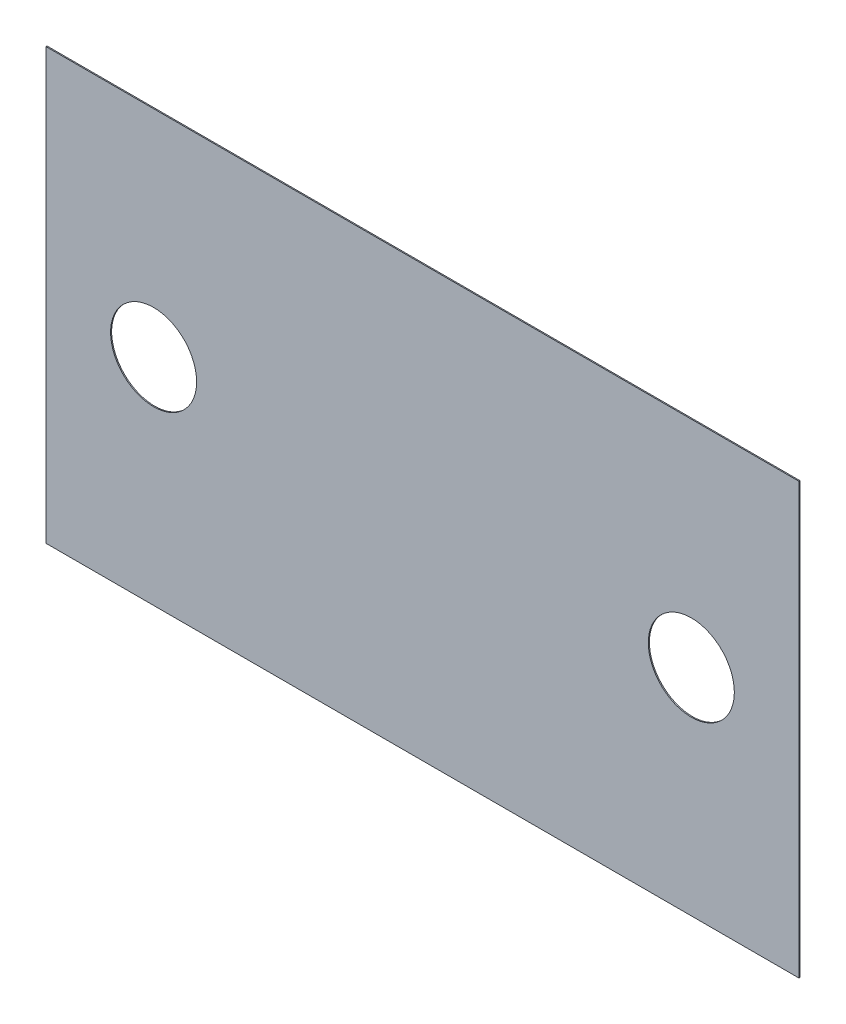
ISO-10303-21;
HEADER;
FILE_DESCRIPTION(('STEP AP214'),'2;1');
FILE_NAME('part.step','',(''),(''),'','','');
FILE_SCHEMA(('AUTOMOTIVE_DESIGN { 1 0 10303 214 1 1 1 1 }'));
ENDSEC;
DATA;
#1=APPLICATION_CONTEXT('core data for automotive mechanical design processes');
#2=APPLICATION_PROTOCOL_DEFINITION('international standard','automotive_design',2000,#1);
#3=PRODUCT_CONTEXT('',#1,'mechanical');
#4=PRODUCT('Part','Part','',(#3));
#5=PRODUCT_RELATED_PRODUCT_CATEGORY('part','',(#4));
#6=PRODUCT_DEFINITION_FORMATION('','',#4);
#7=PRODUCT_DEFINITION_CONTEXT('part definition',#1,'design');
#8=PRODUCT_DEFINITION('design','',#6,#7);
#9=PRODUCT_DEFINITION_SHAPE('','',#8);
#10=(LENGTH_UNIT() NAMED_UNIT(*) SI_UNIT(.MILLI.,.METRE.));
#11=(NAMED_UNIT(*) PLANE_ANGLE_UNIT() SI_UNIT($,.RADIAN.));
#12=(NAMED_UNIT(*) SI_UNIT($,.STERADIAN.) SOLID_ANGLE_UNIT());
#13=UNCERTAINTY_MEASURE_WITH_UNIT(LENGTH_MEASURE(1.E-05),#10,'distance_accuracy_value','');
#14=(GEOMETRIC_REPRESENTATION_CONTEXT(3) GLOBAL_UNCERTAINTY_ASSIGNED_CONTEXT((#13)) GLOBAL_UNIT_ASSIGNED_CONTEXT((#10,
#11,#12)) REPRESENTATION_CONTEXT('',''));
#15=CARTESIAN_POINT('',(0.,0.,0.));
#16=DIRECTION('',(0.,0.,1.));
#17=DIRECTION('',(1.,0.,0.));
#18=AXIS2_PLACEMENT_3D('',#15,#16,#17);
#19=CARTESIAN_POINT('',(-35.,-20.,0.1));
#20=DIRECTION('',(0.,0.,1.));
#21=DIRECTION('',(1.,0.,0.));
#22=AXIS2_PLACEMENT_3D('',#19,#20,#21);
#23=PLANE('',#22);
#24=CARTESIAN_POINT('',(-25.,0.,0.1));
#25=DIRECTION('',(0.,0.,1.));
#26=DIRECTION('',(1.,0.,0.));
#27=AXIS2_PLACEMENT_3D('',#24,#25,#26);
#28=CIRCLE('',#27,4.);
#29=CARTESIAN_POINT('',(-21.,0.,0.1));
#30=VERTEX_POINT('',#29);
#31=EDGE_CURVE('E97',#30,#30,#28,.T.);
#32=ORIENTED_EDGE('',*,*,#31,.F.);
#33=EDGE_LOOP('',(#32));
#34=FACE_BOUND('',#33,.T.);
#35=DIRECTION('',(0.,-1.,0.));
#36=VECTOR('',#35,1.);
#37=CARTESIAN_POINT('',(-35.,20.,0.1));
#38=LINE('',#37,#36);
#39=CARTESIAN_POINT('',(-35.,20.,0.1));
#40=VERTEX_POINT('',#39);
#41=CARTESIAN_POINT('',(-35.,-20.,0.1));
#42=VERTEX_POINT('',#41);
#43=EDGE_CURVE('E82',#40,#42,#38,.T.);
#44=ORIENTED_EDGE('',*,*,#43,.T.);
#45=DIRECTION('',(1.,0.,0.));
#46=VECTOR('',#45,1.);
#47=CARTESIAN_POINT('',(-35.,-20.,0.1));
#48=LINE('',#47,#46);
#49=CARTESIAN_POINT('',(35.,-20.,0.1));
#50=VERTEX_POINT('',#49);
#51=EDGE_CURVE('E77',#42,#50,#48,.T.);
#52=ORIENTED_EDGE('',*,*,#51,.T.);
#53=DIRECTION('',(0.,1.,0.));
#54=VECTOR('',#53,1.);
#55=CARTESIAN_POINT('',(35.,20.,0.1));
#56=LINE('',#55,#54);
#57=CARTESIAN_POINT('',(35.,20.,0.1));
#58=VERTEX_POINT('',#57);
#59=EDGE_CURVE('E80',#50,#58,#56,.T.);
#60=ORIENTED_EDGE('',*,*,#59,.T.);
#61=DIRECTION('',(-1.,0.,0.));
#62=VECTOR('',#61,1.);
#63=CARTESIAN_POINT('',(-35.,20.,0.1));
#64=LINE('',#63,#62);
#65=EDGE_CURVE('E47',#58,#40,#64,.T.);
#66=ORIENTED_EDGE('',*,*,#65,.T.);
#67=EDGE_LOOP('',(#44,#52,#60,#66));
#68=FACE_BOUND('',#67,.T.);
#69=CARTESIAN_POINT('',(25.,0.,0.1));
#70=DIRECTION('',(0.,0.,1.));
#71=DIRECTION('',(1.,0.,0.));
#72=AXIS2_PLACEMENT_3D('',#69,#70,#71);
#73=CIRCLE('',#72,4.);
#74=CARTESIAN_POINT('',(29.,0.,0.1));
#75=VERTEX_POINT('',#74);
#76=EDGE_CURVE('E112',#75,#75,#73,.T.);
#77=ORIENTED_EDGE('',*,*,#76,.F.);
#78=EDGE_LOOP('',(#77));
#79=FACE_BOUND('',#78,.T.);
#80=ADVANCED_FACE('F30',(#34,#68,#79),#23,.T.);
#81=CARTESIAN_POINT('',(-35.,-20.,0.));
#82=DIRECTION('',(0.,0.,1.));
#83=DIRECTION('',(1.,0.,0.));
#84=AXIS2_PLACEMENT_3D('',#81,#82,#83);
#85=PLANE('',#84);
#86=CARTESIAN_POINT('',(-25.,0.,0.));
#87=DIRECTION('',(0.,0.,1.));
#88=DIRECTION('',(1.,0.,0.));
#89=AXIS2_PLACEMENT_3D('',#86,#87,#88);
#90=CIRCLE('',#89,4.);
#91=CARTESIAN_POINT('',(-21.,0.,0.));
#92=VERTEX_POINT('',#91);
#93=EDGE_CURVE('E109',#92,#92,#90,.T.);
#94=ORIENTED_EDGE('',*,*,#93,.T.);
#95=EDGE_LOOP('',(#94));
#96=FACE_BOUND('',#95,.T.);
#97=DIRECTION('',(0.,-1.,0.));
#98=VECTOR('',#97,1.);
#99=CARTESIAN_POINT('',(-35.,20.,0.));
#100=LINE('',#99,#98);
#101=CARTESIAN_POINT('',(-35.,20.,0.));
#102=VERTEX_POINT('',#101);
#103=CARTESIAN_POINT('',(-35.,-20.,0.));
#104=VERTEX_POINT('',#103);
#105=EDGE_CURVE('E94',#102,#104,#100,.T.);
#106=ORIENTED_EDGE('',*,*,#105,.F.);
#107=DIRECTION('',(-1.,0.,0.));
#108=VECTOR('',#107,1.);
#109=CARTESIAN_POINT('',(-35.,20.,0.));
#110=LINE('',#109,#108);
#111=CARTESIAN_POINT('',(35.,20.,0.));
#112=VERTEX_POINT('',#111);
#113=EDGE_CURVE('E70',#112,#102,#110,.T.);
#114=ORIENTED_EDGE('',*,*,#113,.F.);
#115=DIRECTION('',(0.,1.,0.));
#116=VECTOR('',#115,1.);
#117=CARTESIAN_POINT('',(35.,20.,0.));
#118=LINE('',#117,#116);
#119=CARTESIAN_POINT('',(35.,-20.,0.));
#120=VERTEX_POINT('',#119);
#121=EDGE_CURVE('E64',#120,#112,#118,.T.);
#122=ORIENTED_EDGE('',*,*,#121,.F.);
#123=DIRECTION('',(1.,0.,0.));
#124=VECTOR('',#123,1.);
#125=CARTESIAN_POINT('',(-35.,-20.,0.));
#126=LINE('',#125,#124);
#127=EDGE_CURVE('E86',#104,#120,#126,.T.);
#128=ORIENTED_EDGE('',*,*,#127,.F.);
#129=EDGE_LOOP('',(#106,#114,#122,#128));
#130=FACE_BOUND('',#129,.T.);
#131=CARTESIAN_POINT('',(25.,0.,0.));
#132=DIRECTION('',(0.,0.,1.));
#133=DIRECTION('',(1.,0.,0.));
#134=AXIS2_PLACEMENT_3D('',#131,#132,#133);
#135=CIRCLE('',#134,4.);
#136=CARTESIAN_POINT('',(29.,0.,0.));
#137=VERTEX_POINT('',#136);
#138=EDGE_CURVE('E115',#137,#137,#135,.T.);
#139=ORIENTED_EDGE('',*,*,#138,.T.);
#140=EDGE_LOOP('',(#139));
#141=FACE_BOUND('',#140,.T.);
#142=ADVANCED_FACE('F105',(#96,#130,#141),#85,.F.);
#143=CARTESIAN_POINT('',(-35.,20.,0.1));
#144=DIRECTION('',(1.,0.,0.));
#145=DIRECTION('',(0.,1.,0.));
#146=AXIS2_PLACEMENT_3D('',#143,#144,#145);
#147=PLANE('',#146);
#148=ORIENTED_EDGE('',*,*,#105,.T.);
#149=DIRECTION('',(0.,0.,-1.));
#150=VECTOR('',#149,1.);
#151=CARTESIAN_POINT('',(-35.,-20.,0.1));
#152=LINE('',#151,#150);
#153=EDGE_CURVE('E11',#42,#104,#152,.T.);
#154=ORIENTED_EDGE('',*,*,#153,.F.);
#155=ORIENTED_EDGE('',*,*,#43,.F.);
#156=DIRECTION('',(0.,0.,-1.));
#157=VECTOR('',#156,1.);
#158=CARTESIAN_POINT('',(-35.,20.,0.1));
#159=LINE('',#158,#157);
#160=EDGE_CURVE('E90',#40,#102,#159,.T.);
#161=ORIENTED_EDGE('',*,*,#160,.T.);
#162=EDGE_LOOP('',(#148,#154,#155,#161));
#163=FACE_BOUND('',#162,.T.);
#164=ADVANCED_FACE('F32',(#163),#147,.F.);
#165=CARTESIAN_POINT('',(-35.,-20.,0.1));
#166=DIRECTION('',(0.,1.,0.));
#167=DIRECTION('',(0.,0.,1.));
#168=AXIS2_PLACEMENT_3D('',#165,#166,#167);
#169=PLANE('',#168);
#170=ORIENTED_EDGE('',*,*,#127,.T.);
#171=DIRECTION('',(0.,0.,-1.));
#172=VECTOR('',#171,1.);
#173=CARTESIAN_POINT('',(35.,-20.,0.1));
#174=LINE('',#173,#172);
#175=EDGE_CURVE('E39',#50,#120,#174,.T.);
#176=ORIENTED_EDGE('',*,*,#175,.F.);
#177=ORIENTED_EDGE('',*,*,#51,.F.);
#178=ORIENTED_EDGE('',*,*,#153,.T.);
#179=EDGE_LOOP('',(#170,#176,#177,#178));
#180=FACE_BOUND('',#179,.T.);
#181=ADVANCED_FACE('F85',(#180),#169,.F.);
#182=CARTESIAN_POINT('',(35.,20.,0.1));
#183=DIRECTION('',(-1.,0.,0.));
#184=DIRECTION('',(0.,-1.,0.));
#185=AXIS2_PLACEMENT_3D('',#182,#183,#184);
#186=PLANE('',#185);
#187=ORIENTED_EDGE('',*,*,#121,.T.);
#188=DIRECTION('',(0.,0.,-1.));
#189=VECTOR('',#188,1.);
#190=CARTESIAN_POINT('',(35.,20.,0.1));
#191=LINE('',#190,#189);
#192=EDGE_CURVE('E87',#58,#112,#191,.T.);
#193=ORIENTED_EDGE('',*,*,#192,.F.);
#194=ORIENTED_EDGE('',*,*,#59,.F.);
#195=ORIENTED_EDGE('',*,*,#175,.T.);
#196=EDGE_LOOP('',(#187,#193,#194,#195));
#197=FACE_BOUND('',#196,.T.);
#198=ADVANCED_FACE('F88',(#197),#186,.F.);
#199=CARTESIAN_POINT('',(-35.,20.,0.1));
#200=DIRECTION('',(0.,-1.,0.));
#201=DIRECTION('',(0.,0.,-1.));
#202=AXIS2_PLACEMENT_3D('',#199,#200,#201);
#203=PLANE('',#202);
#204=ORIENTED_EDGE('',*,*,#113,.T.);
#205=ORIENTED_EDGE('',*,*,#160,.F.);
#206=ORIENTED_EDGE('',*,*,#65,.F.);
#207=ORIENTED_EDGE('',*,*,#192,.T.);
#208=EDGE_LOOP('',(#204,#205,#206,#207));
#209=FACE_BOUND('',#208,.T.);
#210=ADVANCED_FACE('F102',(#209),#203,.F.);
#211=CARTESIAN_POINT('',(-25.,0.,0.1));
#212=DIRECTION('',(0.,0.,-1.));
#213=DIRECTION('',(-1.,0.,0.));
#214=AXIS2_PLACEMENT_3D('',#211,#212,#213);
#215=CYLINDRICAL_SURFACE('',#214,4.);
#216=ORIENTED_EDGE('',*,*,#31,.T.);
#217=EDGE_LOOP('',(#216));
#218=FACE_BOUND('',#217,.T.);
#219=ORIENTED_EDGE('',*,*,#93,.F.);
#220=EDGE_LOOP('',(#219));
#221=FACE_BOUND('',#220,.T.);
#222=ADVANCED_FACE('F133',(#218,#221),#215,.F.);
#223=CARTESIAN_POINT('',(25.,0.,0.1));
#224=DIRECTION('',(0.,0.,-1.));
#225=DIRECTION('',(-1.,0.,0.));
#226=AXIS2_PLACEMENT_3D('',#223,#224,#225);
#227=CYLINDRICAL_SURFACE('',#226,4.);
#228=ORIENTED_EDGE('',*,*,#76,.T.);
#229=EDGE_LOOP('',(#228));
#230=FACE_BOUND('',#229,.T.);
#231=ORIENTED_EDGE('',*,*,#138,.F.);
#232=EDGE_LOOP('',(#231));
#233=FACE_BOUND('',#232,.T.);
#234=ADVANCED_FACE('F121',(#230,#233),#227,.F.);
#235=CLOSED_SHELL('',(#80,#142,#164,#181,#198,#210,#222,#234));
#236=MANIFOLD_SOLID_BREP('B2',#235);
#237=ADVANCED_BREP_SHAPE_REPRESENTATION('',(#18,#236),#14);
#238=SHAPE_DEFINITION_REPRESENTATION(#9,#237);
ENDSEC;
END-ISO-10303-21;
